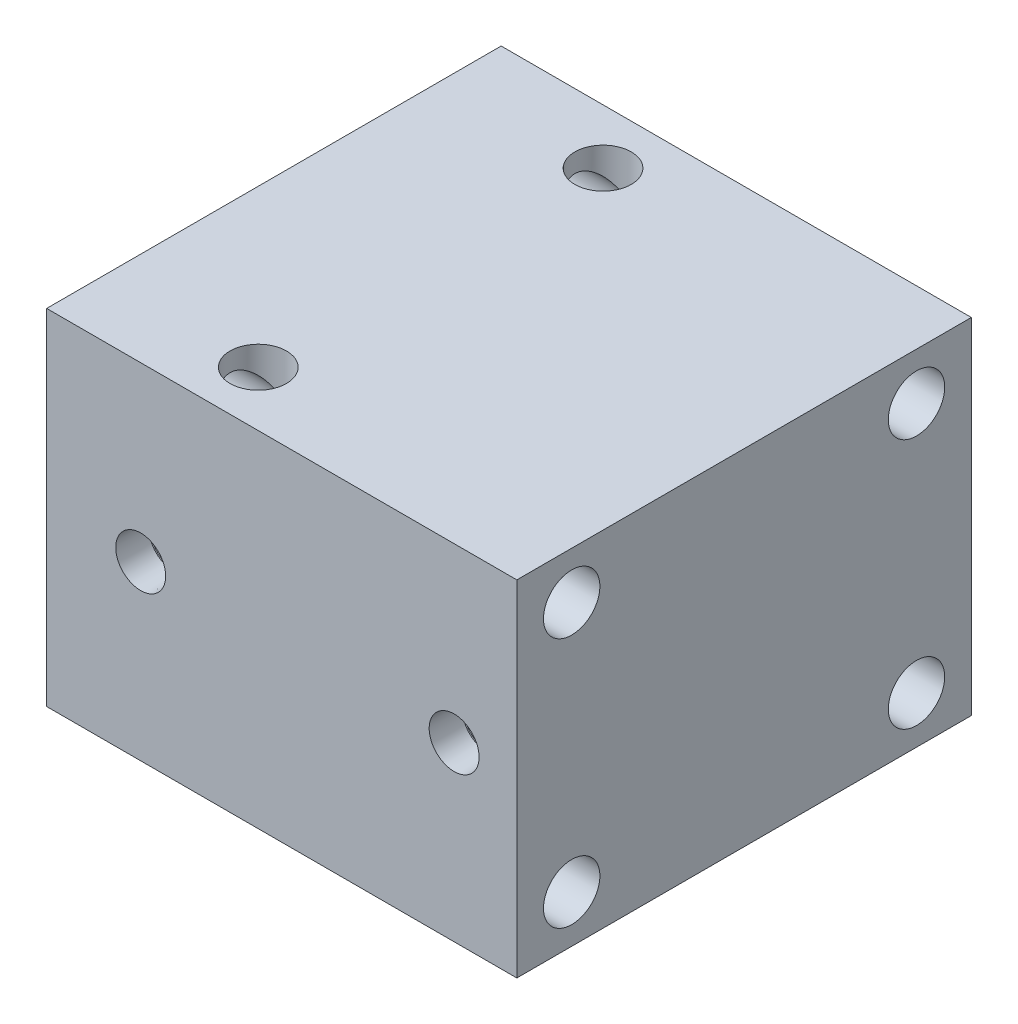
ISO-10303-21;
HEADER;
FILE_DESCRIPTION(('STEP AP214'),'2;1');
FILE_NAME('part.step','',(''),(''),'','','');
FILE_SCHEMA(('AUTOMOTIVE_DESIGN { 1 0 10303 214 1 1 1 1 }'));
ENDSEC;
DATA;
#1=APPLICATION_CONTEXT('core data for automotive mechanical design processes');
#2=APPLICATION_PROTOCOL_DEFINITION('international standard','automotive_design',2000,#1);
#3=PRODUCT_CONTEXT('',#1,'mechanical');
#4=PRODUCT('Part','Part','',(#3));
#5=PRODUCT_RELATED_PRODUCT_CATEGORY('part','',(#4));
#6=PRODUCT_DEFINITION_FORMATION('','',#4);
#7=PRODUCT_DEFINITION_CONTEXT('part definition',#1,'design');
#8=PRODUCT_DEFINITION('design','',#6,#7);
#9=PRODUCT_DEFINITION_SHAPE('','',#8);
#10=(LENGTH_UNIT() NAMED_UNIT(*) SI_UNIT(.MILLI.,.METRE.));
#11=(NAMED_UNIT(*) PLANE_ANGLE_UNIT() SI_UNIT($,.RADIAN.));
#12=(NAMED_UNIT(*) SI_UNIT($,.STERADIAN.) SOLID_ANGLE_UNIT());
#13=UNCERTAINTY_MEASURE_WITH_UNIT(LENGTH_MEASURE(1.E-05),#10,'distance_accuracy_value','');
#14=(GEOMETRIC_REPRESENTATION_CONTEXT(3) GLOBAL_UNCERTAINTY_ASSIGNED_CONTEXT((#13)) GLOBAL_UNIT_ASSIGNED_CONTEXT((#10,
#11,#12)) REPRESENTATION_CONTEXT('',''));
#15=CARTESIAN_POINT('',(0.,0.,0.));
#16=DIRECTION('',(0.,0.,1.));
#17=DIRECTION('',(1.,0.,0.));
#18=AXIS2_PLACEMENT_3D('',#15,#16,#17);
#19=CARTESIAN_POINT('',(-25.,110.,55.));
#20=DIRECTION('',(0.,-1.,0.));
#21=DIRECTION('',(0.,0.,-1.));
#22=AXIS2_PLACEMENT_3D('',#19,#20,#21);
#23=CYLINDRICAL_SURFACE('',#22,9.);
#24=CARTESIAN_POINT('',(-25.,15.,55.));
#25=DIRECTION('',(-0.707106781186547,-0.707106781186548,0.));
#26=DIRECTION('',(0.707106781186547,-0.707106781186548,0.));
#27=AXIS2_PLACEMENT_3D('',#24,#25,#26);
#28=ELLIPSE('',#27,12.7279220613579,9.);
#29=CARTESIAN_POINT('',(-25.,15.,46.));
#30=VERTEX_POINT('',#29);
#31=CARTESIAN_POINT('',(-25.,15.,64.));
#32=VERTEX_POINT('',#31);
#33=EDGE_CURVE('E11',#30,#32,#28,.F.);
#34=ORIENTED_EDGE('',*,*,#33,.F.);
#35=CARTESIAN_POINT('',(-25.,15.,55.));
#36=DIRECTION('',(0.707106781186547,-0.707106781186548,0.));
#37=DIRECTION('',(-0.707106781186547,-0.707106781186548,0.));
#38=AXIS2_PLACEMENT_3D('',#35,#36,#37);
#39=ELLIPSE('',#38,12.7279220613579,9.);
#40=EDGE_CURVE('E53',#32,#30,#39,.F.);
#41=ORIENTED_EDGE('',*,*,#40,.F.);
#42=EDGE_LOOP('',(#34,#41));
#43=FACE_BOUND('',#42,.T.);
#44=CARTESIAN_POINT('',(-25.,95.,55.));
#45=DIRECTION('',(-0.707106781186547,-0.707106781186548,0.));
#46=DIRECTION('',(0.707106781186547,-0.707106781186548,0.));
#47=AXIS2_PLACEMENT_3D('',#44,#45,#46);
#48=ELLIPSE('',#47,12.7279220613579,9.);
#49=CARTESIAN_POINT('',(-25.,95.,46.));
#50=VERTEX_POINT('',#49);
#51=CARTESIAN_POINT('',(-25.,95.,64.));
#52=VERTEX_POINT('',#51);
#53=EDGE_CURVE('E254',#50,#52,#48,.T.);
#54=ORIENTED_EDGE('',*,*,#53,.F.);
#55=CARTESIAN_POINT('',(-25.,95.,55.));
#56=DIRECTION('',(0.707106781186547,-0.707106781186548,0.));
#57=DIRECTION('',(-0.707106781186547,-0.707106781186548,0.));
#58=AXIS2_PLACEMENT_3D('',#55,#56,#57);
#59=ELLIPSE('',#58,12.7279220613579,9.);
#60=EDGE_CURVE('E252',#52,#50,#59,.T.);
#61=ORIENTED_EDGE('',*,*,#60,.F.);
#62=EDGE_LOOP('',(#54,#61));
#63=FACE_BOUND('',#62,.T.);
#64=ADVANCED_FACE('F37',(#43,#63),#23,.F.);
#65=CARTESIAN_POINT('',(-25.,95.,55.));
#66=DIRECTION('',(-0.707106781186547,-0.707106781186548,0.));
#67=DIRECTION('',(0.707106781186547,-0.707106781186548,0.));
#68=AXIS2_PLACEMENT_3D('',#65,#66,#67);
#69=ELLIPSE('',#68,12.7279220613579,9.);
#70=EDGE_CURVE('E114',#50,#52,#69,.F.);
#71=ORIENTED_EDGE('',*,*,#70,.F.);
#72=CARTESIAN_POINT('',(-25.,95.,55.));
#73=DIRECTION('',(0.707106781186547,-0.707106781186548,0.));
#74=DIRECTION('',(-0.707106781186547,-0.707106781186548,0.));
#75=AXIS2_PLACEMENT_3D('',#72,#73,#74);
#76=ELLIPSE('',#75,12.7279220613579,9.);
#77=EDGE_CURVE('E60',#52,#50,#76,.F.);
#78=ORIENTED_EDGE('',*,*,#77,.F.);
#79=EDGE_LOOP('',(#71,#78));
#80=FACE_BOUND('',#79,.T.);
#81=CARTESIAN_POINT('',(-25.,110.,55.));
#82=DIRECTION('',(0.,1.,0.));
#83=DIRECTION('',(0.,0.,1.));
#84=AXIS2_PLACEMENT_3D('',#81,#82,#83);
#85=CIRCLE('',#84,9.);
#86=CARTESIAN_POINT('',(-25.,110.,64.));
#87=VERTEX_POINT('',#86);
#88=EDGE_CURVE('E188',#87,#87,#85,.T.);
#89=ORIENTED_EDGE('',*,*,#88,.T.);
#90=EDGE_LOOP('',(#89));
#91=FACE_BOUND('',#90,.T.);
#92=ADVANCED_FACE('F309',(#80,#91),#23,.F.);
#93=CARTESIAN_POINT('',(-25.,110.,-55.));
#94=DIRECTION('',(0.,-1.,0.));
#95=DIRECTION('',(0.,0.,-1.));
#96=AXIS2_PLACEMENT_3D('',#93,#94,#95);
#97=CYLINDRICAL_SURFACE('',#96,9.);
#98=CARTESIAN_POINT('',(-25.,15.,-55.));
#99=DIRECTION('',(-0.707106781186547,-0.707106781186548,0.));
#100=DIRECTION('',(0.707106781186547,-0.707106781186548,0.));
#101=AXIS2_PLACEMENT_3D('',#98,#99,#100);
#102=ELLIPSE('',#101,12.7279220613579,9.);
#103=CARTESIAN_POINT('',(-25.,15.,-64.));
#104=VERTEX_POINT('',#103);
#105=CARTESIAN_POINT('',(-25.,15.,-46.));
#106=VERTEX_POINT('',#105);
#107=EDGE_CURVE('E248',#104,#106,#102,.F.);
#108=ORIENTED_EDGE('',*,*,#107,.F.);
#109=CARTESIAN_POINT('',(-25.,15.,-55.));
#110=DIRECTION('',(0.707106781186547,-0.707106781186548,0.));
#111=DIRECTION('',(-0.707106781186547,-0.707106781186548,0.));
#112=AXIS2_PLACEMENT_3D('',#109,#110,#111);
#113=ELLIPSE('',#112,12.7279220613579,9.);
#114=EDGE_CURVE('E240',#106,#104,#113,.F.);
#115=ORIENTED_EDGE('',*,*,#114,.F.);
#116=EDGE_LOOP('',(#108,#115));
#117=FACE_BOUND('',#116,.T.);
#118=CARTESIAN_POINT('',(-25.,95.,-55.));
#119=DIRECTION('',(-0.707106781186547,-0.707106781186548,0.));
#120=DIRECTION('',(0.707106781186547,-0.707106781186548,0.));
#121=AXIS2_PLACEMENT_3D('',#118,#119,#120);
#122=ELLIPSE('',#121,12.7279220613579,9.00000000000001);
#123=CARTESIAN_POINT('',(-25.,95.,-64.));
#124=VERTEX_POINT('',#123);
#125=CARTESIAN_POINT('',(-25.,95.,-46.));
#126=VERTEX_POINT('',#125);
#127=EDGE_CURVE('E234',#124,#126,#122,.T.);
#128=ORIENTED_EDGE('',*,*,#127,.F.);
#129=CARTESIAN_POINT('',(-25.,95.,-55.));
#130=DIRECTION('',(0.707106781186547,-0.707106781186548,0.));
#131=DIRECTION('',(-0.707106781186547,-0.707106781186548,0.));
#132=AXIS2_PLACEMENT_3D('',#129,#130,#131);
#133=ELLIPSE('',#132,12.7279220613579,9.00000000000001);
#134=EDGE_CURVE('E232',#126,#124,#133,.T.);
#135=ORIENTED_EDGE('',*,*,#134,.F.);
#136=EDGE_LOOP('',(#128,#135));
#137=FACE_BOUND('',#136,.T.);
#138=ADVANCED_FACE('F314',(#117,#137),#97,.F.);
#139=CARTESIAN_POINT('',(-25.,95.,-55.));
#140=DIRECTION('',(-0.707106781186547,-0.707106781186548,0.));
#141=DIRECTION('',(0.707106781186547,-0.707106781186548,0.));
#142=AXIS2_PLACEMENT_3D('',#139,#140,#141);
#143=ELLIPSE('',#142,12.7279220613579,9.00000000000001);
#144=EDGE_CURVE('E237',#124,#126,#143,.F.);
#145=ORIENTED_EDGE('',*,*,#144,.F.);
#146=CARTESIAN_POINT('',(-25.,95.,-55.));
#147=DIRECTION('',(0.707106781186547,-0.707106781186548,0.));
#148=DIRECTION('',(-0.707106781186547,-0.707106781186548,0.));
#149=AXIS2_PLACEMENT_3D('',#146,#147,#148);
#150=ELLIPSE('',#149,12.7279220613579,9.00000000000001);
#151=EDGE_CURVE('E229',#126,#124,#150,.F.);
#152=ORIENTED_EDGE('',*,*,#151,.F.);
#153=EDGE_LOOP('',(#145,#152));
#154=FACE_BOUND('',#153,.T.);
#155=CARTESIAN_POINT('',(-25.,110.,-55.));
#156=DIRECTION('',(0.,1.,0.));
#157=DIRECTION('',(0.,0.,1.));
#158=AXIS2_PLACEMENT_3D('',#155,#156,#157);
#159=CIRCLE('',#158,9.);
#160=CARTESIAN_POINT('',(-25.,110.,-46.));
#161=VERTEX_POINT('',#160);
#162=EDGE_CURVE('E194',#161,#161,#159,.T.);
#163=ORIENTED_EDGE('',*,*,#162,.T.);
#164=EDGE_LOOP('',(#163));
#165=FACE_BOUND('',#164,.T.);
#166=ADVANCED_FACE('F327',(#154,#165),#97,.F.);
#167=CARTESIAN_POINT('',(-75.,110.,72.5));
#168=DIRECTION('',(0.,1.,0.));
#169=DIRECTION('',(0.,0.,1.));
#170=AXIS2_PLACEMENT_3D('',#167,#168,#169);
#171=PLANE('',#170);
#172=ORIENTED_EDGE('',*,*,#162,.F.);
#173=EDGE_LOOP('',(#172));
#174=FACE_BOUND('',#173,.T.);
#175=DIRECTION('',(0.,0.,1.));
#176=VECTOR('',#175,1.);
#177=CARTESIAN_POINT('',(-75.,110.,-72.5));
#178=LINE('',#177,#176);
#179=CARTESIAN_POINT('',(-75.,110.,-72.5));
#180=VERTEX_POINT('',#179);
#181=CARTESIAN_POINT('',(-75.,110.,72.5));
#182=VERTEX_POINT('',#181);
#183=EDGE_CURVE('E200',#180,#182,#178,.T.);
#184=ORIENTED_EDGE('',*,*,#183,.T.);
#185=DIRECTION('',(1.,0.,0.));
#186=VECTOR('',#185,1.);
#187=CARTESIAN_POINT('',(-75.,110.,72.5));
#188=LINE('',#187,#186);
#189=CARTESIAN_POINT('',(75.,110.,72.5));
#190=VERTEX_POINT('',#189);
#191=EDGE_CURVE('E203',#182,#190,#188,.T.);
#192=ORIENTED_EDGE('',*,*,#191,.T.);
#193=DIRECTION('',(0.,0.,-1.));
#194=VECTOR('',#193,1.);
#195=CARTESIAN_POINT('',(75.,110.,-72.5));
#196=LINE('',#195,#194);
#197=CARTESIAN_POINT('',(75.,110.,-72.5));
#198=VERTEX_POINT('',#197);
#199=EDGE_CURVE('E206',#190,#198,#196,.T.);
#200=ORIENTED_EDGE('',*,*,#199,.T.);
#201=DIRECTION('',(-1.,0.,0.));
#202=VECTOR('',#201,1.);
#203=CARTESIAN_POINT('',(-75.,110.,-72.5));
#204=LINE('',#203,#202);
#205=EDGE_CURVE('E208',#198,#180,#204,.T.);
#206=ORIENTED_EDGE('',*,*,#205,.T.);
#207=EDGE_LOOP('',(#184,#192,#200,#206));
#208=FACE_BOUND('',#207,.T.);
#209=ORIENTED_EDGE('',*,*,#88,.F.);
#210=EDGE_LOOP('',(#209));
#211=FACE_BOUND('',#210,.T.);
#212=ADVANCED_FACE('F297',(#174,#208,#211),#171,.T.);
#213=CARTESIAN_POINT('',(-75.,0.,72.5));
#214=DIRECTION('',(0.,1.,0.));
#215=DIRECTION('',(0.,0.,1.));
#216=AXIS2_PLACEMENT_3D('',#213,#214,#215);
#217=PLANE('',#216);
#218=CARTESIAN_POINT('',(-25.,0.,-55.));
#219=DIRECTION('',(0.,1.,0.));
#220=DIRECTION('',(0.,0.,1.));
#221=AXIS2_PLACEMENT_3D('',#218,#219,#220);
#222=CIRCLE('',#221,9.);
#223=CARTESIAN_POINT('',(-25.,0.,-46.));
#224=VERTEX_POINT('',#223);
#225=EDGE_CURVE('E191',#224,#224,#222,.T.);
#226=ORIENTED_EDGE('',*,*,#225,.T.);
#227=EDGE_LOOP('',(#226));
#228=FACE_BOUND('',#227,.T.);
#229=DIRECTION('',(0.,0.,1.));
#230=VECTOR('',#229,1.);
#231=CARTESIAN_POINT('',(-75.,0.,-72.5));
#232=LINE('',#231,#230);
#233=CARTESIAN_POINT('',(-75.,0.,-72.5));
#234=VERTEX_POINT('',#233);
#235=CARTESIAN_POINT('',(-75.,0.,72.5));
#236=VERTEX_POINT('',#235);
#237=EDGE_CURVE('E197',#234,#236,#232,.T.);
#238=ORIENTED_EDGE('',*,*,#237,.F.);
#239=DIRECTION('',(-1.,0.,0.));
#240=VECTOR('',#239,1.);
#241=CARTESIAN_POINT('',(-75.,0.,-72.5));
#242=LINE('',#241,#240);
#243=CARTESIAN_POINT('',(75.,0.,-72.5));
#244=VERTEX_POINT('',#243);
#245=EDGE_CURVE('E204',#244,#234,#242,.T.);
#246=ORIENTED_EDGE('',*,*,#245,.F.);
#247=DIRECTION('',(0.,0.,-1.));
#248=VECTOR('',#247,1.);
#249=CARTESIAN_POINT('',(75.,0.,-72.5));
#250=LINE('',#249,#248);
#251=CARTESIAN_POINT('',(75.,0.,72.5));
#252=VERTEX_POINT('',#251);
#253=EDGE_CURVE('E215',#252,#244,#250,.T.);
#254=ORIENTED_EDGE('',*,*,#253,.F.);
#255=DIRECTION('',(1.,0.,0.));
#256=VECTOR('',#255,1.);
#257=CARTESIAN_POINT('',(-75.,0.,72.5));
#258=LINE('',#257,#256);
#259=EDGE_CURVE('E213',#236,#252,#258,.T.);
#260=ORIENTED_EDGE('',*,*,#259,.F.);
#261=EDGE_LOOP('',(#238,#246,#254,#260));
#262=FACE_BOUND('',#261,.T.);
#263=CARTESIAN_POINT('',(-25.,0.,55.));
#264=DIRECTION('',(0.,1.,0.));
#265=DIRECTION('',(0.,0.,1.));
#266=AXIS2_PLACEMENT_3D('',#263,#264,#265);
#267=CIRCLE('',#266,9.);
#268=CARTESIAN_POINT('',(-25.,0.,64.));
#269=VERTEX_POINT('',#268);
#270=EDGE_CURVE('E185',#269,#269,#267,.T.);
#271=ORIENTED_EDGE('',*,*,#270,.T.);
#272=EDGE_LOOP('',(#271));
#273=FACE_BOUND('',#272,.T.);
#274=ADVANCED_FACE('F291',(#228,#262,#273),#217,.F.);
#275=CARTESIAN_POINT('',(-75.,110.,-72.5));
#276=DIRECTION('',(1.,0.,0.));
#277=DIRECTION('',(0.,0.,-1.));
#278=AXIS2_PLACEMENT_3D('',#275,#276,#277);
#279=PLANE('',#278);
#280=CARTESIAN_POINT('',(-75.,15.,55.));
#281=DIRECTION('',(-1.,0.,0.));
#282=DIRECTION('',(0.,0.,1.));
#283=AXIS2_PLACEMENT_3D('',#280,#281,#282);
#284=CIRCLE('',#283,9.);
#285=CARTESIAN_POINT('',(-75.,15.,64.));
#286=VERTEX_POINT('',#285);
#287=EDGE_CURVE('E122',#286,#286,#284,.T.);
#288=ORIENTED_EDGE('',*,*,#287,.F.);
#289=EDGE_LOOP('',(#288));
#290=FACE_BOUND('',#289,.T.);
#291=CARTESIAN_POINT('',(-75.,95.,55.));
#292=DIRECTION('',(-1.,0.,0.));
#293=DIRECTION('',(0.,0.,1.));
#294=AXIS2_PLACEMENT_3D('',#291,#292,#293);
#295=CIRCLE('',#294,8.99999999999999);
#296=CARTESIAN_POINT('',(-75.,95.,64.));
#297=VERTEX_POINT('',#296);
#298=EDGE_CURVE('E139',#297,#297,#295,.T.);
#299=ORIENTED_EDGE('',*,*,#298,.F.);
#300=EDGE_LOOP('',(#299));
#301=FACE_BOUND('',#300,.T.);
#302=CARTESIAN_POINT('',(-75.,15.,-55.));
#303=DIRECTION('',(-1.,0.,0.));
#304=DIRECTION('',(0.,0.,1.));
#305=AXIS2_PLACEMENT_3D('',#302,#303,#304);
#306=CIRCLE('',#305,9.);
#307=CARTESIAN_POINT('',(-75.,15.,-46.));
#308=VERTEX_POINT('',#307);
#309=EDGE_CURVE('E145',#308,#308,#306,.T.);
#310=ORIENTED_EDGE('',*,*,#309,.F.);
#311=EDGE_LOOP('',(#310));
#312=FACE_BOUND('',#311,.T.);
#313=CARTESIAN_POINT('',(-75.,95.,-55.));
#314=DIRECTION('',(-1.,0.,0.));
#315=DIRECTION('',(0.,0.,1.));
#316=AXIS2_PLACEMENT_3D('',#313,#314,#315);
#317=CIRCLE('',#316,9.00000000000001);
#318=CARTESIAN_POINT('',(-75.,95.,-46.));
#319=VERTEX_POINT('',#318);
#320=EDGE_CURVE('E151',#319,#319,#317,.T.);
#321=ORIENTED_EDGE('',*,*,#320,.F.);
#322=EDGE_LOOP('',(#321));
#323=FACE_BOUND('',#322,.T.);
#324=CARTESIAN_POINT('',(-75.,55.,0.));
#325=DIRECTION('',(-1.,0.,0.));
#326=DIRECTION('',(0.,0.,1.));
#327=AXIS2_PLACEMENT_3D('',#324,#325,#326);
#328=CIRCLE('',#327,1.5);
#329=CARTESIAN_POINT('',(-75.,55.,1.5));
#330=VERTEX_POINT('',#329);
#331=EDGE_CURVE('E181',#330,#330,#328,.T.);
#332=ORIENTED_EDGE('',*,*,#331,.F.);
#333=EDGE_LOOP('',(#332));
#334=FACE_BOUND('',#333,.T.);
#335=ORIENTED_EDGE('',*,*,#237,.T.);
#336=DIRECTION('',(0.,-1.,0.));
#337=VECTOR('',#336,1.);
#338=CARTESIAN_POINT('',(-75.,110.,72.5));
#339=LINE('',#338,#337);
#340=EDGE_CURVE('E226',#182,#236,#339,.T.);
#341=ORIENTED_EDGE('',*,*,#340,.F.);
#342=ORIENTED_EDGE('',*,*,#183,.F.);
#343=DIRECTION('',(0.,-1.,0.));
#344=VECTOR('',#343,1.);
#345=CARTESIAN_POINT('',(-75.,110.,-72.5));
#346=LINE('',#345,#344);
#347=EDGE_CURVE('E210',#180,#234,#346,.T.);
#348=ORIENTED_EDGE('',*,*,#347,.T.);
#349=EDGE_LOOP('',(#335,#341,#342,#348));
#350=FACE_BOUND('',#349,.T.);
#351=ADVANCED_FACE('F39',(#290,#301,#312,#323,#334,#350),#279,.F.);
#352=CARTESIAN_POINT('',(-75.,110.,72.5));
#353=DIRECTION('',(0.,0.,-1.));
#354=DIRECTION('',(-1.,0.,0.));
#355=AXIS2_PLACEMENT_3D('',#352,#353,#354);
#356=PLANE('',#355);
#357=CARTESIAN_POINT('',(55.,55.,72.5));
#358=DIRECTION('',(0.,0.,1.));
#359=DIRECTION('',(1.,0.,0.));
#360=AXIS2_PLACEMENT_3D('',#357,#358,#359);
#361=CIRCLE('',#360,7.963027);
#362=CARTESIAN_POINT('',(62.963027,55.,72.5));
#363=VERTEX_POINT('',#362);
#364=EDGE_CURVE('E157',#363,#363,#361,.T.);
#365=ORIENTED_EDGE('',*,*,#364,.F.);
#366=EDGE_LOOP('',(#365));
#367=FACE_BOUND('',#366,.T.);
#368=CARTESIAN_POINT('',(-45.,55.,72.5));
#369=DIRECTION('',(0.,0.,1.));
#370=DIRECTION('',(1.,0.,0.));
#371=AXIS2_PLACEMENT_3D('',#368,#369,#370);
#372=CIRCLE('',#371,7.963027);
#373=CARTESIAN_POINT('',(-37.036973,55.,72.5));
#374=VERTEX_POINT('',#373);
#375=EDGE_CURVE('E169',#374,#374,#372,.T.);
#376=ORIENTED_EDGE('',*,*,#375,.F.);
#377=EDGE_LOOP('',(#376));
#378=FACE_BOUND('',#377,.T.);
#379=ORIENTED_EDGE('',*,*,#259,.T.);
#380=DIRECTION('',(0.,-1.,0.));
#381=VECTOR('',#380,1.);
#382=CARTESIAN_POINT('',(75.,110.,72.5));
#383=LINE('',#382,#381);
#384=EDGE_CURVE('E223',#190,#252,#383,.T.);
#385=ORIENTED_EDGE('',*,*,#384,.F.);
#386=ORIENTED_EDGE('',*,*,#191,.F.);
#387=ORIENTED_EDGE('',*,*,#340,.T.);
#388=EDGE_LOOP('',(#379,#385,#386,#387));
#389=FACE_BOUND('',#388,.T.);
#390=ADVANCED_FACE('F274',(#367,#378,#389),#356,.F.);
#391=CARTESIAN_POINT('',(75.,110.,-72.5));
#392=DIRECTION('',(-1.,0.,0.));
#393=DIRECTION('',(0.,0.,1.));
#394=AXIS2_PLACEMENT_3D('',#391,#392,#393);
#395=PLANE('',#394);
#396=CARTESIAN_POINT('',(75.,15.,55.));
#397=DIRECTION('',(-1.,0.,0.));
#398=DIRECTION('',(0.,0.,1.));
#399=AXIS2_PLACEMENT_3D('',#396,#397,#398);
#400=CIRCLE('',#399,9.);
#401=CARTESIAN_POINT('',(75.,15.,64.));
#402=VERTEX_POINT('',#401);
#403=EDGE_CURVE('E127',#402,#402,#400,.F.);
#404=ORIENTED_EDGE('',*,*,#403,.F.);
#405=EDGE_LOOP('',(#404));
#406=FACE_BOUND('',#405,.T.);
#407=CARTESIAN_POINT('',(75.,95.,55.));
#408=DIRECTION('',(-1.,0.,0.));
#409=DIRECTION('',(0.,0.,1.));
#410=AXIS2_PLACEMENT_3D('',#407,#408,#409);
#411=CIRCLE('',#410,8.99999999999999);
#412=CARTESIAN_POINT('',(75.,95.,64.));
#413=VERTEX_POINT('',#412);
#414=EDGE_CURVE('E142',#413,#413,#411,.F.);
#415=ORIENTED_EDGE('',*,*,#414,.F.);
#416=EDGE_LOOP('',(#415));
#417=FACE_BOUND('',#416,.T.);
#418=CARTESIAN_POINT('',(75.,15.,-55.));
#419=DIRECTION('',(-1.,0.,0.));
#420=DIRECTION('',(0.,0.,1.));
#421=AXIS2_PLACEMENT_3D('',#418,#419,#420);
#422=CIRCLE('',#421,9.);
#423=CARTESIAN_POINT('',(75.,15.,-46.));
#424=VERTEX_POINT('',#423);
#425=EDGE_CURVE('E148',#424,#424,#422,.F.);
#426=ORIENTED_EDGE('',*,*,#425,.F.);
#427=EDGE_LOOP('',(#426));
#428=FACE_BOUND('',#427,.T.);
#429=CARTESIAN_POINT('',(75.,95.,-55.));
#430=DIRECTION('',(-1.,0.,0.));
#431=DIRECTION('',(0.,0.,1.));
#432=AXIS2_PLACEMENT_3D('',#429,#430,#431);
#433=CIRCLE('',#432,9.00000000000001);
#434=CARTESIAN_POINT('',(75.,95.,-46.));
#435=VERTEX_POINT('',#434);
#436=EDGE_CURVE('E154',#435,#435,#433,.F.);
#437=ORIENTED_EDGE('',*,*,#436,.F.);
#438=EDGE_LOOP('',(#437));
#439=FACE_BOUND('',#438,.T.);
#440=ORIENTED_EDGE('',*,*,#253,.T.);
#441=DIRECTION('',(0.,-1.,0.));
#442=VECTOR('',#441,1.);
#443=CARTESIAN_POINT('',(75.,110.,-72.5));
#444=LINE('',#443,#442);
#445=EDGE_CURVE('E220',#198,#244,#444,.T.);
#446=ORIENTED_EDGE('',*,*,#445,.F.);
#447=ORIENTED_EDGE('',*,*,#199,.F.);
#448=ORIENTED_EDGE('',*,*,#384,.T.);
#449=EDGE_LOOP('',(#440,#446,#447,#448));
#450=FACE_BOUND('',#449,.T.);
#451=ADVANCED_FACE('F270',(#406,#417,#428,#439,#450),#395,.F.);
#452=CARTESIAN_POINT('',(-75.,110.,-72.5));
#453=DIRECTION('',(0.,0.,1.));
#454=DIRECTION('',(1.,0.,0.));
#455=AXIS2_PLACEMENT_3D('',#452,#453,#454);
#456=PLANE('',#455);
#457=ORIENTED_EDGE('',*,*,#245,.T.);
#458=ORIENTED_EDGE('',*,*,#347,.F.);
#459=ORIENTED_EDGE('',*,*,#205,.F.);
#460=ORIENTED_EDGE('',*,*,#445,.T.);
#461=EDGE_LOOP('',(#457,#458,#459,#460));
#462=FACE_BOUND('',#461,.T.);
#463=ADVANCED_FACE('F273',(#462),#456,.F.);
#464=CARTESIAN_POINT('',(-25.,15.,-55.));
#465=DIRECTION('',(-0.707106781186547,-0.707106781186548,0.));
#466=DIRECTION('',(0.707106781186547,-0.707106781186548,0.));
#467=AXIS2_PLACEMENT_3D('',#464,#465,#466);
#468=ELLIPSE('',#467,12.7279220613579,9.);
#469=EDGE_CURVE('E245',#104,#106,#468,.T.);
#470=ORIENTED_EDGE('',*,*,#469,.F.);
#471=CARTESIAN_POINT('',(-25.,15.,-55.));
#472=DIRECTION('',(0.707106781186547,-0.707106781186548,0.));
#473=DIRECTION('',(-0.707106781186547,-0.707106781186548,0.));
#474=AXIS2_PLACEMENT_3D('',#471,#472,#473);
#475=ELLIPSE('',#474,12.7279220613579,9.);
#476=EDGE_CURVE('E243',#106,#104,#475,.T.);
#477=ORIENTED_EDGE('',*,*,#476,.F.);
#478=EDGE_LOOP('',(#470,#477));
#479=FACE_BOUND('',#478,.T.);
#480=ORIENTED_EDGE('',*,*,#225,.F.);
#481=EDGE_LOOP('',(#480));
#482=FACE_BOUND('',#481,.T.);
#483=ADVANCED_FACE('F319',(#479,#482),#97,.F.);
#484=CARTESIAN_POINT('',(-25.,15.,55.));
#485=DIRECTION('',(-0.707106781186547,-0.707106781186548,0.));
#486=DIRECTION('',(0.707106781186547,-0.707106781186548,0.));
#487=AXIS2_PLACEMENT_3D('',#484,#485,#486);
#488=ELLIPSE('',#487,12.7279220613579,9.);
#489=EDGE_CURVE('E46',#30,#32,#488,.T.);
#490=ORIENTED_EDGE('',*,*,#489,.F.);
#491=CARTESIAN_POINT('',(-25.,15.,55.));
#492=DIRECTION('',(0.707106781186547,-0.707106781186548,0.));
#493=DIRECTION('',(-0.707106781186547,-0.707106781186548,0.));
#494=AXIS2_PLACEMENT_3D('',#491,#492,#493);
#495=ELLIPSE('',#494,12.7279220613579,9.);
#496=EDGE_CURVE('E105',#32,#30,#495,.T.);
#497=ORIENTED_EDGE('',*,*,#496,.F.);
#498=EDGE_LOOP('',(#490,#497));
#499=FACE_BOUND('',#498,.T.);
#500=ORIENTED_EDGE('',*,*,#270,.F.);
#501=EDGE_LOOP('',(#500));
#502=FACE_BOUND('',#501,.T.);
#503=ADVANCED_FACE('F117',(#499,#502),#23,.F.);
#504=CARTESIAN_POINT('',(-15.,55.,0.));
#505=DIRECTION('',(-1.,0.,0.));
#506=DIRECTION('',(0.,0.,1.));
#507=AXIS2_PLACEMENT_3D('',#504,#505,#506);
#508=CYLINDRICAL_SURFACE('',#507,1.5);
#509=CARTESIAN_POINT('',(-15.,55.,0.));
#510=DIRECTION('',(-1.,0.,0.));
#511=DIRECTION('',(0.,0.,1.));
#512=AXIS2_PLACEMENT_3D('',#509,#510,#511);
#513=CIRCLE('',#512,1.5);
#514=CARTESIAN_POINT('',(-15.,55.,1.49999999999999));
#515=VERTEX_POINT('',#514);
#516=EDGE_CURVE('E182',#515,#515,#513,.T.);
#517=ORIENTED_EDGE('',*,*,#516,.F.);
#518=EDGE_LOOP('',(#517));
#519=FACE_BOUND('',#518,.T.);
#520=ORIENTED_EDGE('',*,*,#331,.T.);
#521=EDGE_LOOP('',(#520));
#522=FACE_BOUND('',#521,.T.);
#523=ADVANCED_FACE('F318',(#519,#522),#508,.F.);
#524=CARTESIAN_POINT('',(-15.,55.,0.));
#525=DIRECTION('',(-1.,0.,0.));
#526=DIRECTION('',(0.,0.,1.));
#527=AXIS2_PLACEMENT_3D('',#524,#525,#526);
#528=PLANE('',#527);
#529=ORIENTED_EDGE('',*,*,#516,.T.);
#530=EDGE_LOOP('',(#529));
#531=FACE_BOUND('',#530,.T.);
#532=ADVANCED_FACE('F324',(#531),#528,.T.);
#533=CARTESIAN_POINT('',(-45.,55.,55.12));
#534=DIRECTION('',(0.,0.,1.));
#535=DIRECTION('',(1.,0.,0.));
#536=AXIS2_PLACEMENT_3D('',#533,#534,#535);
#537=CONICAL_SURFACE('',#536,7.1374,1.02974425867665);
#538=CARTESIAN_POINT('',(-45.,55.,52.0331386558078));
#539=DIRECTION('',(0.,0.,1.));
#540=DIRECTION('',(1.,0.,0.));
#541=AXIS2_PLACEMENT_3D('',#538,#539,#540);
#542=CIRCLE('',#541,2.00000000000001);
#543=CARTESIAN_POINT('',(-43.,55.,52.0331386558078));
#544=VERTEX_POINT('',#543);
#545=EDGE_CURVE('E120',#544,#544,#542,.F.);
#546=CARTESIAN_POINT('',(-45.,55.,55.12));
#547=DIRECTION('',(0.,0.,1.));
#548=DIRECTION('',(1.,0.,0.));
#549=AXIS2_PLACEMENT_3D('',#546,#547,#548);
#550=CIRCLE('',#549,7.1374);
#551=CARTESIAN_POINT('',(-37.8626,55.,55.12));
#552=VERTEX_POINT('',#551);
#553=EDGE_CURVE('E178',#552,#552,#550,.T.);
#554=CARTESIAN_POINT('',(-43.,55.,52.0331386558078));
#555=CARTESIAN_POINT('',(-42.9464854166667,55.,52.0652934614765));
#556=CARTESIAN_POINT('',(-42.8929708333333,55.,52.0974482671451));
#557=CARTESIAN_POINT('',(-42.7859416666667,55.,52.1617578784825));
#558=CARTESIAN_POINT('',(-42.7324270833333,55.,52.1939126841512));
#559=CARTESIAN_POINT('',(-42.6253979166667,55.,52.2582222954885));
#560=CARTESIAN_POINT('',(-42.5718833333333,55.,52.2903771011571));
#561=CARTESIAN_POINT('',(-42.4648541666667,55.,52.3546867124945));
#562=CARTESIAN_POINT('',(-42.4113395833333,55.,52.3868415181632));
#563=CARTESIAN_POINT('',(-42.3043104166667,55.,52.4511511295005));
#564=CARTESIAN_POINT('',(-42.2507958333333,55.,52.4833059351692));
#565=CARTESIAN_POINT('',(-42.1437666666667,55.,52.5476155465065));
#566=CARTESIAN_POINT('',(-42.0902520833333,55.,52.5797703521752));
#567=CARTESIAN_POINT('',(-41.9832229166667,55.,52.6440799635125));
#568=CARTESIAN_POINT('',(-41.9297083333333,55.,52.6762347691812));
#569=CARTESIAN_POINT('',(-41.8226791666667,55.,52.7405443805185));
#570=CARTESIAN_POINT('',(-41.7691645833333,55.,52.7726991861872));
#571=CARTESIAN_POINT('',(-41.6621354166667,55.,52.8370087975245));
#572=CARTESIAN_POINT('',(-41.6086208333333,55.,52.8691636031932));
#573=CARTESIAN_POINT('',(-41.5015916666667,55.,52.9334732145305));
#574=CARTESIAN_POINT('',(-41.4480770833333,55.,52.9656280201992));
#575=CARTESIAN_POINT('',(-41.3410479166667,55.,53.0299376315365));
#576=CARTESIAN_POINT('',(-41.2875333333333,55.,53.0620924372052));
#577=CARTESIAN_POINT('',(-41.1805041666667,55.,53.1264020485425));
#578=CARTESIAN_POINT('',(-41.1269895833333,55.,53.1585568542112));
#579=CARTESIAN_POINT('',(-41.0199604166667,55.,53.2228664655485));
#580=CARTESIAN_POINT('',(-40.9664458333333,55.,53.2550212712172));
#581=CARTESIAN_POINT('',(-40.8594166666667,55.,53.3193308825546));
#582=CARTESIAN_POINT('',(-40.8059020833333,55.,53.3514856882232));
#583=CARTESIAN_POINT('',(-40.6988729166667,55.,53.4157952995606));
#584=CARTESIAN_POINT('',(-40.6453583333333,55.,53.4479501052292));
#585=CARTESIAN_POINT('',(-40.5383291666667,55.,53.5122597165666));
#586=CARTESIAN_POINT('',(-40.4848145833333,55.,53.5444145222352));
#587=CARTESIAN_POINT('',(-40.3777854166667,55.,53.6087241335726));
#588=CARTESIAN_POINT('',(-40.3242708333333,55.,53.6408789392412));
#589=CARTESIAN_POINT('',(-40.2172416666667,55.,53.7051885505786));
#590=CARTESIAN_POINT('',(-40.1637270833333,55.,53.7373433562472));
#591=CARTESIAN_POINT('',(-40.0566979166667,55.,53.8016529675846));
#592=CARTESIAN_POINT('',(-40.0031833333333,55.,53.8338077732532));
#593=CARTESIAN_POINT('',(-39.8961541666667,55.,53.8981173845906));
#594=CARTESIAN_POINT('',(-39.8426395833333,55.,53.9302721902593));
#595=CARTESIAN_POINT('',(-39.7356104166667,55.,53.9945818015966));
#596=CARTESIAN_POINT('',(-39.6820958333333,55.,54.0267366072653));
#597=CARTESIAN_POINT('',(-39.5750666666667,55.,54.0910462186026));
#598=CARTESIAN_POINT('',(-39.5215520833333,55.,54.1232010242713));
#599=CARTESIAN_POINT('',(-39.4145229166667,55.,54.1875106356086));
#600=CARTESIAN_POINT('',(-39.3610083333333,55.,54.2196654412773));
#601=CARTESIAN_POINT('',(-39.2539791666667,55.,54.2839750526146));
#602=CARTESIAN_POINT('',(-39.2004645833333,55.,54.3161298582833));
#603=CARTESIAN_POINT('',(-39.0934354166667,55.,54.3804394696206));
#604=CARTESIAN_POINT('',(-39.0399208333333,55.,54.4125942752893));
#605=CARTESIAN_POINT('',(-38.9328916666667,55.,54.4769038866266));
#606=CARTESIAN_POINT('',(-38.8793770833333,55.,54.5090586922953));
#607=CARTESIAN_POINT('',(-38.7723479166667,55.,54.5733683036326));
#608=CARTESIAN_POINT('',(-38.7188333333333,55.,54.6055231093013));
#609=CARTESIAN_POINT('',(-38.6118041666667,55.,54.6698327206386));
#610=CARTESIAN_POINT('',(-38.5582895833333,55.,54.7019875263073));
#611=CARTESIAN_POINT('',(-38.4512604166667,55.,54.7662971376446));
#612=CARTESIAN_POINT('',(-38.3977458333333,55.,54.7984519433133));
#613=CARTESIAN_POINT('',(-38.2907166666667,55.,54.8627615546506));
#614=CARTESIAN_POINT('',(-38.2372020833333,55.,54.8949163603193));
#615=CARTESIAN_POINT('',(-38.1301729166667,55.,54.9592259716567));
#616=CARTESIAN_POINT('',(-38.0766583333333,55.,54.9913807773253));
#617=CARTESIAN_POINT('',(-37.9696291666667,55.,55.0556903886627));
#618=CARTESIAN_POINT('',(-37.9161145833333,55.,55.0878451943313));
#619=CARTESIAN_POINT('',(-37.8626,55.,55.12));
#620=B_SPLINE_CURVE_WITH_KNOTS('',3,(#554,#555,#556,#557,#558,#559,#560,#561,#562,#563,#564,
#565,#566,#567,#568,#569,#570,#571,#572,#573,#574,#575,#576,#577,#578,#579,#580,#581,#582,#583,
#584,#585,#586,#587,#588,#589,#590,#591,#592,#593,#594,#595,#596,#597,#598,#599,#600,#601,#602,
#603,#604,#605,#606,#607,#608,#609,#610,#611,#612,#613,#614,#615,#616,#617,#618,#619),
.UNSPECIFIED.,.F.,.F.,(4,2,2,2,2,2,2,2,2,2,2,2,2,2,2,2,2,2,2,2,2,2,2,2,2,2,2,2,2,2,2,2,4),(0.,
0.187295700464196,0.374591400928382,0.561887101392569,0.749182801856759,0.936478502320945,
1.12377420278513,1.31106990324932,1.49836560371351,1.6856613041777,1.87295700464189,
2.06025270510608,2.24754840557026,2.43484410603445,2.62213980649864,2.80943550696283,
2.99673120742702,3.18402690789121,3.3713226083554,3.55861830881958,3.74591400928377,
3.93320970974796,4.12050541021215,4.30780111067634,4.49509681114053,4.68239251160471,
4.8696882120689,5.0569839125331,5.24427961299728,5.43157531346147,5.61887101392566,
5.80616671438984,5.99346241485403),.UNSPECIFIED.);
#621=EDGE_CURVE('BSEAM389',#544,#552,#620,.T.);
#622=ORIENTED_EDGE('',*,*,#545,.T.);
#623=ORIENTED_EDGE('',*,*,#553,.T.);
#624=ORIENTED_EDGE('',*,*,#621,.T.);
#625=ORIENTED_EDGE('',*,*,#621,.F.);
#626=EDGE_LOOP('',(#622,#624,#623,#625));
#627=FACE_BOUND('',#626,.T.);
#628=ADVANCED_FACE('F389',(#627),#537,.F.);
#629=CARTESIAN_POINT('',(-45.,55.,72.5));
#630=DIRECTION('',(0.,0.,1.));
#631=DIRECTION('',(1.,0.,0.));
#632=AXIS2_PLACEMENT_3D('',#629,#630,#631);
#633=CYLINDRICAL_SURFACE('',#632,7.1374);
#634=ORIENTED_EDGE('',*,*,#553,.F.);
#635=EDGE_LOOP('',(#634));
#636=FACE_BOUND('',#635,.T.);
#637=CARTESIAN_POINT('',(-45.,55.,62.17));
#638=DIRECTION('',(0.,0.,1.));
#639=DIRECTION('',(1.,0.,0.));
#640=AXIS2_PLACEMENT_3D('',#637,#638,#639);
#641=CIRCLE('',#640,7.1374);
#642=CARTESIAN_POINT('',(-37.8626,55.,62.17));
#643=VERTEX_POINT('',#642);
#644=EDGE_CURVE('E175',#643,#643,#641,.T.);
#645=ORIENTED_EDGE('',*,*,#644,.T.);
#646=EDGE_LOOP('',(#645));
#647=FACE_BOUND('',#646,.T.);
#648=ADVANCED_FACE('F385',(#636,#647),#633,.F.);
#649=CARTESIAN_POINT('',(-37.8626,55.,62.17));
#650=DIRECTION('',(0.,0.,-1.));
#651=DIRECTION('',(-1.,0.,0.));
#652=AXIS2_PLACEMENT_3D('',#649,#650,#651);
#653=PLANE('',#652);
#654=ORIENTED_EDGE('',*,*,#644,.F.);
#655=EDGE_LOOP('',(#654));
#656=FACE_BOUND('',#655,.T.);
#657=CARTESIAN_POINT('',(-45.,55.,62.17));
#658=DIRECTION('',(0.,0.,1.));
#659=DIRECTION('',(1.,0.,0.));
#660=AXIS2_PLACEMENT_3D('',#657,#658,#659);
#661=CIRCLE('',#660,7.65373296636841);
#662=CARTESIAN_POINT('',(-37.3462670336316,55.,62.17));
#663=VERTEX_POINT('',#662);
#664=EDGE_CURVE('E172',#663,#663,#661,.T.);
#665=ORIENTED_EDGE('',*,*,#664,.T.);
#666=EDGE_LOOP('',(#665));
#667=FACE_BOUND('',#666,.T.);
#668=ADVANCED_FACE('F381',(#656,#667),#653,.F.);
#669=CARTESIAN_POINT('',(-45.,55.,72.5));
#670=DIRECTION('',(0.,0.,1.));
#671=DIRECTION('',(1.,0.,0.));
#672=AXIS2_PLACEMENT_3D('',#669,#670,#671);
#673=CONICAL_SURFACE('',#672,7.963027,0.0299323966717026);
#674=ORIENTED_EDGE('',*,*,#664,.F.);
#675=EDGE_LOOP('',(#674));
#676=FACE_BOUND('',#675,.T.);
#677=ORIENTED_EDGE('',*,*,#375,.T.);
#678=EDGE_LOOP('',(#677));
#679=FACE_BOUND('',#678,.T.);
#680=ADVANCED_FACE('F377',(#676,#679),#673,.F.);
#681=CARTESIAN_POINT('',(55.,55.,55.12));
#682=DIRECTION('',(0.,0.,1.));
#683=DIRECTION('',(1.,0.,0.));
#684=AXIS2_PLACEMENT_3D('',#681,#682,#683);
#685=CONICAL_SURFACE('',#684,7.1374,1.02974425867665);
#686=CARTESIAN_POINT('',(55.,55.,52.0331386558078));
#687=DIRECTION('',(0.,0.,1.));
#688=DIRECTION('',(1.,0.,0.));
#689=AXIS2_PLACEMENT_3D('',#686,#687,#688);
#690=CIRCLE('',#689,2.);
#691=CARTESIAN_POINT('',(57.,55.,52.0331386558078));
#692=VERTEX_POINT('',#691);
#693=EDGE_CURVE('E41',#692,#692,#690,.F.);
#694=CARTESIAN_POINT('',(55.,55.,55.12));
#695=DIRECTION('',(0.,0.,1.));
#696=DIRECTION('',(1.,0.,0.));
#697=AXIS2_PLACEMENT_3D('',#694,#695,#696);
#698=CIRCLE('',#697,7.1374);
#699=CARTESIAN_POINT('',(62.1374,55.,55.12));
#700=VERTEX_POINT('',#699);
#701=EDGE_CURVE('E166',#700,#700,#698,.T.);
#702=CARTESIAN_POINT('',(57.,55.,52.0331386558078));
#703=CARTESIAN_POINT('',(57.0535145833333,55.,52.0652934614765));
#704=CARTESIAN_POINT('',(57.1070291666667,55.,52.0974482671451));
#705=CARTESIAN_POINT('',(57.2140583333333,55.,52.1617578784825));
#706=CARTESIAN_POINT('',(57.2675729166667,55.,52.1939126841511));
#707=CARTESIAN_POINT('',(57.3746020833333,55.,52.2582222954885));
#708=CARTESIAN_POINT('',(57.4281166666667,55.,52.2903771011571));
#709=CARTESIAN_POINT('',(57.5351458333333,55.,52.3546867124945));
#710=CARTESIAN_POINT('',(57.5886604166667,55.,52.3868415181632));
#711=CARTESIAN_POINT('',(57.6956895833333,55.,52.4511511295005));
#712=CARTESIAN_POINT('',(57.7492041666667,55.,52.4833059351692));
#713=CARTESIAN_POINT('',(57.8562333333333,55.,52.5476155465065));
#714=CARTESIAN_POINT('',(57.9097479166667,55.,52.5797703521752));
#715=CARTESIAN_POINT('',(58.0167770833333,55.,52.6440799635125));
#716=CARTESIAN_POINT('',(58.0702916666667,55.,52.6762347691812));
#717=CARTESIAN_POINT('',(58.1773208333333,55.,52.7405443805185));
#718=CARTESIAN_POINT('',(58.2308354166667,55.,52.7726991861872));
#719=CARTESIAN_POINT('',(58.3378645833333,55.,52.8370087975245));
#720=CARTESIAN_POINT('',(58.3913791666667,55.,52.8691636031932));
#721=CARTESIAN_POINT('',(58.4984083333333,55.,52.9334732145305));
#722=CARTESIAN_POINT('',(58.5519229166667,55.,52.9656280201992));
#723=CARTESIAN_POINT('',(58.6589520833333,55.,53.0299376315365));
#724=CARTESIAN_POINT('',(58.7124666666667,55.,53.0620924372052));
#725=CARTESIAN_POINT('',(58.8194958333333,55.,53.1264020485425));
#726=CARTESIAN_POINT('',(58.8730104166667,55.,53.1585568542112));
#727=CARTESIAN_POINT('',(58.9800395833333,55.,53.2228664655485));
#728=CARTESIAN_POINT('',(59.0335541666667,55.,53.2550212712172));
#729=CARTESIAN_POINT('',(59.1405833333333,55.,53.3193308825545));
#730=CARTESIAN_POINT('',(59.1940979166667,55.,53.3514856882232));
#731=CARTESIAN_POINT('',(59.3011270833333,55.,53.4157952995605));
#732=CARTESIAN_POINT('',(59.3546416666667,55.,53.4479501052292));
#733=CARTESIAN_POINT('',(59.4616708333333,55.,53.5122597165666));
#734=CARTESIAN_POINT('',(59.5151854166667,55.,53.5444145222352));
#735=CARTESIAN_POINT('',(59.6222145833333,55.,53.6087241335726));
#736=CARTESIAN_POINT('',(59.6757291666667,55.,53.6408789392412));
#737=CARTESIAN_POINT('',(59.7827583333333,55.,53.7051885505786));
#738=CARTESIAN_POINT('',(59.8362729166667,55.,53.7373433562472));
#739=CARTESIAN_POINT('',(59.9433020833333,55.,53.8016529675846));
#740=CARTESIAN_POINT('',(59.9968166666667,55.,53.8338077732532));
#741=CARTESIAN_POINT('',(60.1038458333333,55.,53.8981173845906));
#742=CARTESIAN_POINT('',(60.1573604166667,55.,53.9302721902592));
#743=CARTESIAN_POINT('',(60.2643895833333,55.,53.9945818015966));
#744=CARTESIAN_POINT('',(60.3179041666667,55.,54.0267366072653));
#745=CARTESIAN_POINT('',(60.4249333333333,55.,54.0910462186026));
#746=CARTESIAN_POINT('',(60.4784479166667,55.,54.1232010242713));
#747=CARTESIAN_POINT('',(60.5854770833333,55.,54.1875106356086));
#748=CARTESIAN_POINT('',(60.6389916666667,55.,54.2196654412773));
#749=CARTESIAN_POINT('',(60.7460208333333,55.,54.2839750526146));
#750=CARTESIAN_POINT('',(60.7995354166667,55.,54.3161298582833));
#751=CARTESIAN_POINT('',(60.9065645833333,55.,54.3804394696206));
#752=CARTESIAN_POINT('',(60.9600791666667,55.,54.4125942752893));
#753=CARTESIAN_POINT('',(61.0671083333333,55.,54.4769038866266));
#754=CARTESIAN_POINT('',(61.1206229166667,55.,54.5090586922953));
#755=CARTESIAN_POINT('',(61.2276520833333,55.,54.5733683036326));
#756=CARTESIAN_POINT('',(61.2811666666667,55.,54.6055231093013));
#757=CARTESIAN_POINT('',(61.3881958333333,55.,54.6698327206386));
#758=CARTESIAN_POINT('',(61.4417104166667,55.,54.7019875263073));
#759=CARTESIAN_POINT('',(61.5487395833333,55.,54.7662971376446));
#760=CARTESIAN_POINT('',(61.6022541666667,55.,54.7984519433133));
#761=CARTESIAN_POINT('',(61.7092833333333,55.,54.8627615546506));
#762=CARTESIAN_POINT('',(61.7627979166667,55.,54.8949163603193));
#763=CARTESIAN_POINT('',(61.8698270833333,55.,54.9592259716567));
#764=CARTESIAN_POINT('',(61.9233416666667,55.,54.9913807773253));
#765=CARTESIAN_POINT('',(62.0303708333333,55.,55.0556903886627));
#766=CARTESIAN_POINT('',(62.0838854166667,55.,55.0878451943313));
#767=CARTESIAN_POINT('',(62.1374,55.,55.12));
#768=B_SPLINE_CURVE_WITH_KNOTS('',3,(#702,#703,#704,#705,#706,#707,#708,#709,#710,#711,#712,
#713,#714,#715,#716,#717,#718,#719,#720,#721,#722,#723,#724,#725,#726,#727,#728,#729,#730,#731,
#732,#733,#734,#735,#736,#737,#738,#739,#740,#741,#742,#743,#744,#745,#746,#747,#748,#749,#750,
#751,#752,#753,#754,#755,#756,#757,#758,#759,#760,#761,#762,#763,#764,#765,#766,#767),
.UNSPECIFIED.,.F.,.F.,(4,2,2,2,2,2,2,2,2,2,2,2,2,2,2,2,2,2,2,2,2,2,2,2,2,2,2,2,2,2,2,2,4),(0.,
0.187295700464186,0.374591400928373,0.561887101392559,0.749182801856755,0.936478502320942,
1.12377420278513,1.31106990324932,1.4983656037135,1.6856613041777,1.87295700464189,
2.06025270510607,2.24754840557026,2.43484410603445,2.62213980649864,2.80943550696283,
2.99673120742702,3.1840269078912,3.37132260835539,3.55861830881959,3.74591400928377,
3.93320970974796,4.12050541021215,4.30780111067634,4.49509681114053,4.68239251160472,
4.8696882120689,5.05698391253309,5.24427961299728,5.43157531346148,5.61887101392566,
5.80616671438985,5.99346241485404),.UNSPECIFIED.);
#769=EDGE_CURVE('BSEAM373',#692,#700,#768,.T.);
#770=ORIENTED_EDGE('',*,*,#693,.T.);
#771=ORIENTED_EDGE('',*,*,#701,.T.);
#772=ORIENTED_EDGE('',*,*,#769,.T.);
#773=ORIENTED_EDGE('',*,*,#769,.F.);
#774=EDGE_LOOP('',(#770,#772,#771,#773));
#775=FACE_BOUND('',#774,.T.);
#776=ADVANCED_FACE('F373',(#775),#685,.F.);
#777=CARTESIAN_POINT('',(55.,55.,72.5));
#778=DIRECTION('',(0.,0.,1.));
#779=DIRECTION('',(1.,0.,0.));
#780=AXIS2_PLACEMENT_3D('',#777,#778,#779);
#781=CYLINDRICAL_SURFACE('',#780,7.1374);
#782=ORIENTED_EDGE('',*,*,#701,.F.);
#783=EDGE_LOOP('',(#782));
#784=FACE_BOUND('',#783,.T.);
#785=CARTESIAN_POINT('',(55.,55.,62.17));
#786=DIRECTION('',(0.,0.,1.));
#787=DIRECTION('',(1.,0.,0.));
#788=AXIS2_PLACEMENT_3D('',#785,#786,#787);
#789=CIRCLE('',#788,7.1374);
#790=CARTESIAN_POINT('',(62.1374,55.,62.17));
#791=VERTEX_POINT('',#790);
#792=EDGE_CURVE('E163',#791,#791,#789,.T.);
#793=ORIENTED_EDGE('',*,*,#792,.T.);
#794=EDGE_LOOP('',(#793));
#795=FACE_BOUND('',#794,.T.);
#796=ADVANCED_FACE('F369',(#784,#795),#781,.F.);
#797=CARTESIAN_POINT('',(62.1374,55.,62.17));
#798=DIRECTION('',(0.,0.,-1.));
#799=DIRECTION('',(-1.,0.,0.));
#800=AXIS2_PLACEMENT_3D('',#797,#798,#799);
#801=PLANE('',#800);
#802=ORIENTED_EDGE('',*,*,#792,.F.);
#803=EDGE_LOOP('',(#802));
#804=FACE_BOUND('',#803,.T.);
#805=CARTESIAN_POINT('',(55.,55.,62.17));
#806=DIRECTION('',(0.,0.,1.));
#807=DIRECTION('',(1.,0.,0.));
#808=AXIS2_PLACEMENT_3D('',#805,#806,#807);
#809=CIRCLE('',#808,7.65373296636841);
#810=CARTESIAN_POINT('',(62.6537329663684,55.,62.17));
#811=VERTEX_POINT('',#810);
#812=EDGE_CURVE('E160',#811,#811,#809,.T.);
#813=ORIENTED_EDGE('',*,*,#812,.T.);
#814=EDGE_LOOP('',(#813));
#815=FACE_BOUND('',#814,.T.);
#816=ADVANCED_FACE('F362',(#804,#815),#801,.F.);
#817=CARTESIAN_POINT('',(55.,55.,72.5));
#818=DIRECTION('',(0.,0.,1.));
#819=DIRECTION('',(1.,0.,0.));
#820=AXIS2_PLACEMENT_3D('',#817,#818,#819);
#821=CONICAL_SURFACE('',#820,7.963027,0.0299323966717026);
#822=ORIENTED_EDGE('',*,*,#812,.F.);
#823=EDGE_LOOP('',(#822));
#824=FACE_BOUND('',#823,.T.);
#825=ORIENTED_EDGE('',*,*,#364,.T.);
#826=EDGE_LOOP('',(#825));
#827=FACE_BOUND('',#826,.T.);
#828=ADVANCED_FACE('F355',(#824,#827),#821,.F.);
#829=CARTESIAN_POINT('',(100.455844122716,95.,-55.));
#830=DIRECTION('',(-1.,0.,0.));
#831=DIRECTION('',(0.,0.,1.));
#832=AXIS2_PLACEMENT_3D('',#829,#830,#831);
#833=CYLINDRICAL_SURFACE('',#832,9.00000000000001);
#834=ORIENTED_EDGE('',*,*,#127,.T.);
#835=ORIENTED_EDGE('',*,*,#151,.T.);
#836=EDGE_LOOP('',(#834,#835));
#837=FACE_BOUND('',#836,.T.);
#838=ORIENTED_EDGE('',*,*,#436,.T.);
#839=EDGE_LOOP('',(#838));
#840=FACE_BOUND('',#839,.T.);
#841=ADVANCED_FACE('F351',(#837,#840),#833,.F.);
#842=ORIENTED_EDGE('',*,*,#144,.T.);
#843=ORIENTED_EDGE('',*,*,#134,.T.);
#844=EDGE_LOOP('',(#842,#843));
#845=FACE_BOUND('',#844,.T.);
#846=ORIENTED_EDGE('',*,*,#320,.T.);
#847=EDGE_LOOP('',(#846));
#848=FACE_BOUND('',#847,.T.);
#849=ADVANCED_FACE('F354',(#845,#848),#833,.F.);
#850=CARTESIAN_POINT('',(100.455844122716,15.,-55.));
#851=DIRECTION('',(-1.,0.,0.));
#852=DIRECTION('',(0.,0.,1.));
#853=AXIS2_PLACEMENT_3D('',#850,#851,#852);
#854=CYLINDRICAL_SURFACE('',#853,9.);
#855=ORIENTED_EDGE('',*,*,#469,.T.);
#856=ORIENTED_EDGE('',*,*,#114,.T.);
#857=EDGE_LOOP('',(#855,#856));
#858=FACE_BOUND('',#857,.T.);
#859=ORIENTED_EDGE('',*,*,#425,.T.);
#860=EDGE_LOOP('',(#859));
#861=FACE_BOUND('',#860,.T.);
#862=ADVANCED_FACE('F361',(#858,#861),#854,.F.);
#863=ORIENTED_EDGE('',*,*,#107,.T.);
#864=ORIENTED_EDGE('',*,*,#476,.T.);
#865=EDGE_LOOP('',(#863,#864));
#866=FACE_BOUND('',#865,.T.);
#867=ORIENTED_EDGE('',*,*,#309,.T.);
#868=EDGE_LOOP('',(#867));
#869=FACE_BOUND('',#868,.T.);
#870=ADVANCED_FACE('F266',(#866,#869),#854,.F.);
#871=CARTESIAN_POINT('',(100.455844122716,95.,55.));
#872=DIRECTION('',(-1.,0.,0.));
#873=DIRECTION('',(0.,0.,1.));
#874=AXIS2_PLACEMENT_3D('',#871,#872,#873);
#875=CYLINDRICAL_SURFACE('',#874,8.99999999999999);
#876=ORIENTED_EDGE('',*,*,#53,.T.);
#877=ORIENTED_EDGE('',*,*,#77,.T.);
#878=EDGE_LOOP('',(#876,#877));
#879=FACE_BOUND('',#878,.T.);
#880=ORIENTED_EDGE('',*,*,#414,.T.);
#881=EDGE_LOOP('',(#880));
#882=FACE_BOUND('',#881,.T.);
#883=ADVANCED_FACE('F263',(#879,#882),#875,.F.);
#884=ORIENTED_EDGE('',*,*,#70,.T.);
#885=ORIENTED_EDGE('',*,*,#60,.T.);
#886=EDGE_LOOP('',(#884,#885));
#887=FACE_BOUND('',#886,.T.);
#888=ORIENTED_EDGE('',*,*,#298,.T.);
#889=EDGE_LOOP('',(#888));
#890=FACE_BOUND('',#889,.T.);
#891=ADVANCED_FACE('F259',(#887,#890),#875,.F.);
#892=CARTESIAN_POINT('',(100.455844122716,15.,55.));
#893=DIRECTION('',(-1.,0.,0.));
#894=DIRECTION('',(0.,0.,1.));
#895=AXIS2_PLACEMENT_3D('',#892,#893,#894);
#896=CYLINDRICAL_SURFACE('',#895,9.);
#897=ORIENTED_EDGE('',*,*,#489,.T.);
#898=ORIENTED_EDGE('',*,*,#40,.T.);
#899=EDGE_LOOP('',(#897,#898));
#900=FACE_BOUND('',#899,.T.);
#901=ORIENTED_EDGE('',*,*,#403,.T.);
#902=EDGE_LOOP('',(#901));
#903=FACE_BOUND('',#902,.T.);
#904=ADVANCED_FACE('F112',(#900,#903),#896,.F.);
#905=ORIENTED_EDGE('',*,*,#33,.T.);
#906=ORIENTED_EDGE('',*,*,#496,.T.);
#907=EDGE_LOOP('',(#905,#906));
#908=FACE_BOUND('',#907,.T.);
#909=ORIENTED_EDGE('',*,*,#287,.T.);
#910=EDGE_LOOP('',(#909));
#911=FACE_BOUND('',#910,.T.);
#912=ADVANCED_FACE('F106',(#908,#911),#896,.F.);
#913=CARTESIAN_POINT('',(-45.,55.,42.5));
#914=DIRECTION('',(0.,0.,1.));
#915=DIRECTION('',(1.,0.,0.));
#916=AXIS2_PLACEMENT_3D('',#913,#914,#915);
#917=CYLINDRICAL_SURFACE('',#916,2.00000000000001);
#918=CARTESIAN_POINT('',(-45.,55.,42.5));
#919=DIRECTION('',(0.,0.,1.));
#920=DIRECTION('',(1.,0.,0.));
#921=AXIS2_PLACEMENT_3D('',#918,#919,#920);
#922=CIRCLE('',#921,2.00000000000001);
#923=CARTESIAN_POINT('',(-43.,55.,42.5));
#924=VERTEX_POINT('',#923);
#925=EDGE_CURVE('E123',#924,#924,#922,.T.);
#926=ORIENTED_EDGE('',*,*,#925,.F.);
#927=EDGE_LOOP('',(#926));
#928=FACE_BOUND('',#927,.T.);
#929=ORIENTED_EDGE('',*,*,#545,.F.);
#930=EDGE_LOOP('',(#929));
#931=FACE_BOUND('',#930,.T.);
#932=ADVANCED_FACE('F541',(#928,#931),#917,.F.);
#933=CARTESIAN_POINT('',(-45.,55.,42.5));
#934=DIRECTION('',(0.,0.,1.));
#935=DIRECTION('',(1.,0.,0.));
#936=AXIS2_PLACEMENT_3D('',#933,#934,#935);
#937=PLANE('',#936);
#938=ORIENTED_EDGE('',*,*,#925,.T.);
#939=EDGE_LOOP('',(#938));
#940=FACE_BOUND('',#939,.T.);
#941=ADVANCED_FACE('F561',(#940),#937,.T.);
#942=CARTESIAN_POINT('',(55.,55.,42.5));
#943=DIRECTION('',(0.,0.,1.));
#944=DIRECTION('',(1.,0.,0.));
#945=AXIS2_PLACEMENT_3D('',#942,#943,#944);
#946=CYLINDRICAL_SURFACE('',#945,2.);
#947=CARTESIAN_POINT('',(55.,55.,42.5));
#948=DIRECTION('',(0.,0.,1.));
#949=DIRECTION('',(1.,0.,0.));
#950=AXIS2_PLACEMENT_3D('',#947,#948,#949);
#951=CIRCLE('',#950,2.);
#952=CARTESIAN_POINT('',(57.,55.,42.5));
#953=VERTEX_POINT('',#952);
#954=EDGE_CURVE('E134',#953,#953,#951,.T.);
#955=ORIENTED_EDGE('',*,*,#954,.F.);
#956=EDGE_LOOP('',(#955));
#957=FACE_BOUND('',#956,.T.);
#958=ORIENTED_EDGE('',*,*,#693,.F.);
#959=EDGE_LOOP('',(#958));
#960=FACE_BOUND('',#959,.T.);
#961=ADVANCED_FACE('F572',(#957,#960),#946,.F.);
#962=CARTESIAN_POINT('',(55.,55.,42.5));
#963=DIRECTION('',(0.,0.,1.));
#964=DIRECTION('',(1.,0.,0.));
#965=AXIS2_PLACEMENT_3D('',#962,#963,#964);
#966=PLANE('',#965);
#967=ORIENTED_EDGE('',*,*,#954,.T.);
#968=EDGE_LOOP('',(#967));
#969=FACE_BOUND('',#968,.T.);
#970=ADVANCED_FACE('F582',(#969),#966,.T.);
#971=CLOSED_SHELL('',(#64,#92,#138,#166,#212,#274,#351,#390,#451,#463,#483,#503,#523,#532,#628,
#648,#668,#680,#776,#796,#816,#828,#841,#849,#862,#870,#883,#891,#904,#912,#932,#941,#961,#970));
#972=MANIFOLD_SOLID_BREP('B2',#971);
#973=ADVANCED_BREP_SHAPE_REPRESENTATION('',(#18,#972),#14);
#974=SHAPE_DEFINITION_REPRESENTATION(#9,#973);
ENDSEC;
END-ISO-10303-21;
